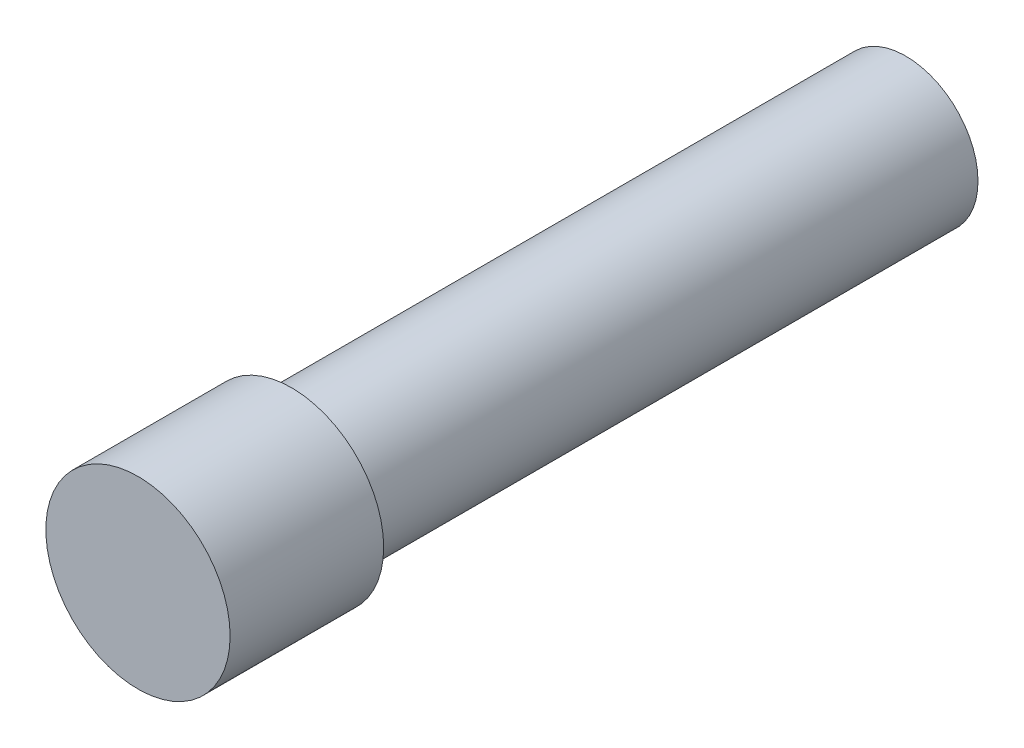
from build123d import *

# Parameters (mm, degrees)
SKIZZE1_R                       = 1.175
AUFSATZ_LINEAR_AUSTRAGEN1_DEPTH = 12.5
SKIZZE2_R                       = 1.5
AUFSATZ_LINEAR_AUSTRAGEN2_DEPTH = 2.5


with BuildPart() as part:
    # Skizze1 → Aufsatz-Linear austragen1 (new body)
    with BuildSketch(Plane.XY):
        Circle(SKIZZE1_R)
    extrude(amount=AUFSATZ_LINEAR_AUSTRAGEN1_DEPTH)

    # Skizze2 → Aufsatz-Linear austragen2 (add)
    with BuildSketch(Plane.XY.offset(12.5)):
        Circle(SKIZZE2_R)
    extrude(amount=-AUFSATZ_LINEAR_AUSTRAGEN2_DEPTH)


solid = part.part
